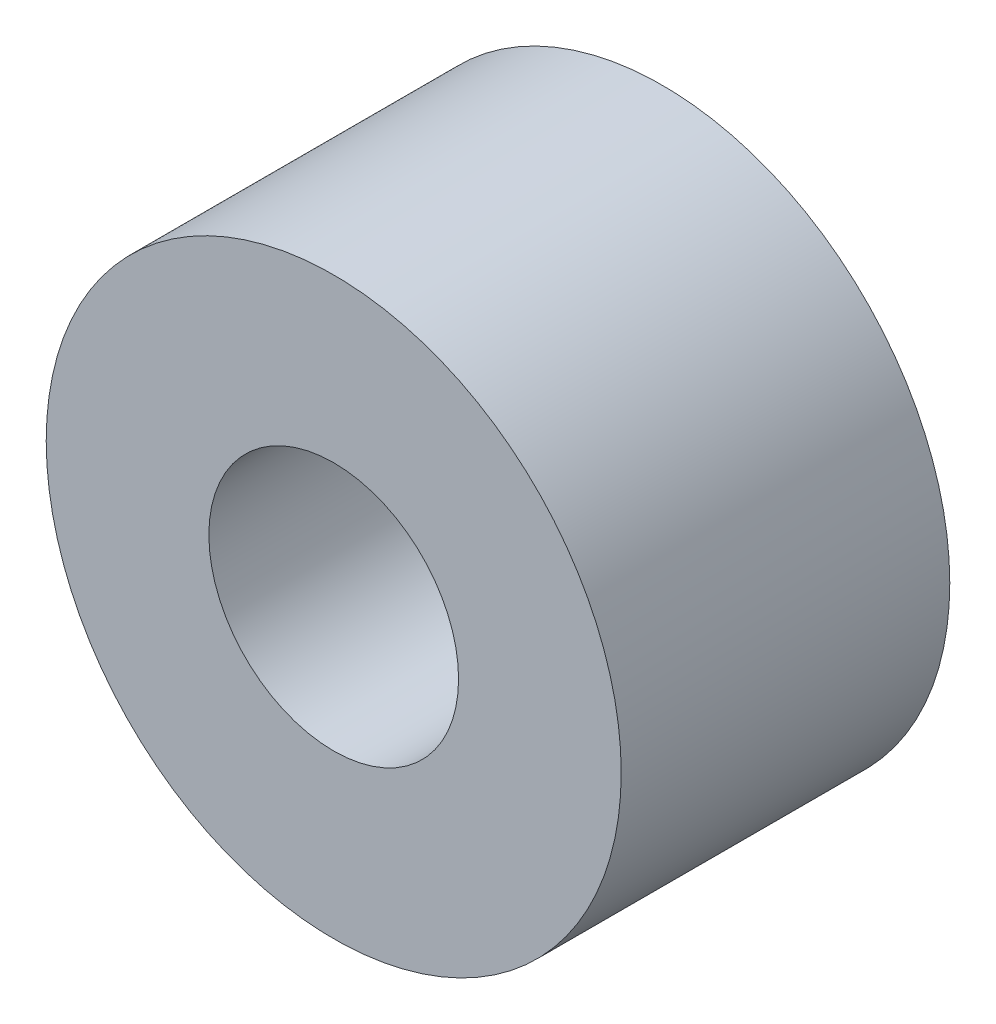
from build123d import *

# Parameters (mm, degrees)
SKETCH1_R           = 5.55625
BOSS_EXTRUDE1_DEPTH = 3.175
SKETCH2_R           = 2.413
CUT_EXTRUDE1_DEPTH  = 11.102788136


with BuildPart() as part:
    # Sketch1 → Boss-Extrude1 (new, symmetric)
    with BuildSketch(Plane.XY):
        Circle(SKETCH1_R)
    extrude(amount=BOSS_EXTRUDE1_DEPTH, both=True)

    # Sketch2 → Cut-Extrude1 (cut, through all)
    with BuildSketch(Plane.XY.offset(3.175)):
        Circle(SKETCH2_R)
    extrude(amount=-CUT_EXTRUDE1_DEPTH, mode=Mode.SUBTRACT)


solid = part.part
